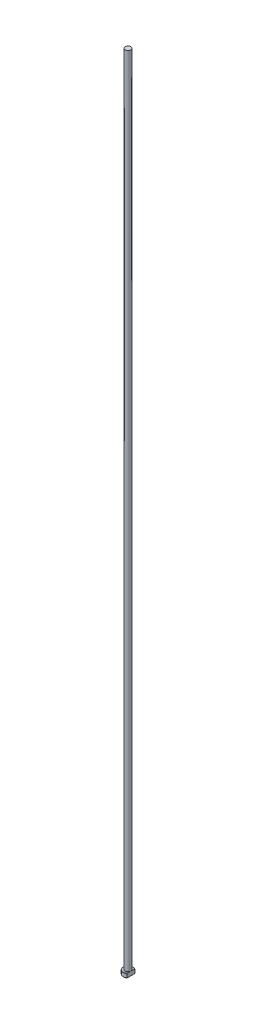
ISO-10303-21;
HEADER;
FILE_DESCRIPTION(('STEP AP214'),'2;1');
FILE_NAME('part.step','',(''),(''),'','','');
FILE_SCHEMA(('AUTOMOTIVE_DESIGN { 1 0 10303 214 1 1 1 1 }'));
ENDSEC;
DATA;
#1=APPLICATION_CONTEXT('core data for automotive mechanical design processes');
#2=APPLICATION_PROTOCOL_DEFINITION('international standard','automotive_design',2000,#1);
#3=PRODUCT_CONTEXT('',#1,'mechanical');
#4=PRODUCT('Part','Part','',(#3));
#5=PRODUCT_RELATED_PRODUCT_CATEGORY('part','',(#4));
#6=PRODUCT_DEFINITION_FORMATION('','',#4);
#7=PRODUCT_DEFINITION_CONTEXT('part definition',#1,'design');
#8=PRODUCT_DEFINITION('design','',#6,#7);
#9=PRODUCT_DEFINITION_SHAPE('','',#8);
#10=(LENGTH_UNIT() NAMED_UNIT(*) SI_UNIT(.MILLI.,.METRE.));
#11=(NAMED_UNIT(*) PLANE_ANGLE_UNIT() SI_UNIT($,.RADIAN.));
#12=(NAMED_UNIT(*) SI_UNIT($,.STERADIAN.) SOLID_ANGLE_UNIT());
#13=UNCERTAINTY_MEASURE_WITH_UNIT(LENGTH_MEASURE(1.E-05),#10,'distance_accuracy_value','');
#14=(GEOMETRIC_REPRESENTATION_CONTEXT(3) GLOBAL_UNCERTAINTY_ASSIGNED_CONTEXT((#13)) GLOBAL_UNIT_ASSIGNED_CONTEXT((#10,
#11,#12)) REPRESENTATION_CONTEXT('',''));
#15=CARTESIAN_POINT('',(0.,0.,0.));
#16=DIRECTION('',(0.,0.,1.));
#17=DIRECTION('',(1.,0.,0.));
#18=AXIS2_PLACEMENT_3D('',#15,#16,#17);
#19=CARTESIAN_POINT('',(0.,0.,0.));
#20=DIRECTION('',(0.,-1.,0.));
#21=DIRECTION('',(0.,0.,-1.));
#22=AXIS2_PLACEMENT_3D('',#19,#20,#21);
#23=PLANE('',#22);
#24=CARTESIAN_POINT('',(0.,0.,0.));
#25=DIRECTION('',(0.,-1.,0.));
#26=DIRECTION('',(0.,0.,-1.));
#27=AXIS2_PLACEMENT_3D('',#24,#25,#26);
#28=CIRCLE('',#27,5.79999999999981);
#29=CARTESIAN_POINT('',(3.49999999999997,0.,4.62493243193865));
#30=VERTEX_POINT('',#29);
#31=CARTESIAN_POINT('',(3.49999999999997,0.,-4.62493243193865));
#32=VERTEX_POINT('',#31);
#33=EDGE_CURVE('E98',#30,#32,#28,.T.);
#34=ORIENTED_EDGE('',*,*,#33,.T.);
#35=DIRECTION('',(0.,0.,1.));
#36=VECTOR('',#35,1.);
#37=CARTESIAN_POINT('',(3.49999999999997,0.,-4.87339717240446));
#38=LINE('',#37,#36);
#39=EDGE_CURVE('E83',#32,#30,#38,.T.);
#40=ORIENTED_EDGE('',*,*,#39,.T.);
#41=EDGE_LOOP('',(#34,#40));
#42=FACE_BOUND('',#41,.T.);
#43=ADVANCED_FACE('F32',(#42),#23,.T.);
#44=CARTESIAN_POINT('',(0.,259.958771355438,0.));
#45=DIRECTION('',(0.,1.,0.));
#46=DIRECTION('',(0.,0.,1.));
#47=AXIS2_PLACEMENT_3D('',#44,#45,#46);
#48=CYLINDRICAL_SURFACE('',#47,5.99999999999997);
#49=CARTESIAN_POINT('',(0.,4.80000000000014,0.));
#50=DIRECTION('',(0.,1.,0.));
#51=DIRECTION('',(0.,0.,1.));
#52=AXIS2_PLACEMENT_3D('',#49,#50,#51);
#53=CIRCLE('',#52,5.99999999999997);
#54=CARTESIAN_POINT('',(3.49999999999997,4.80000000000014,4.87339717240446));
#55=VERTEX_POINT('',#54);
#56=CARTESIAN_POINT('',(3.49999999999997,4.80000000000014,-4.87339717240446));
#57=VERTEX_POINT('',#56);
#58=EDGE_CURVE('E104',#55,#57,#53,.F.);
#59=ORIENTED_EDGE('',*,*,#58,.T.);
#60=DIRECTION('',(0.,-1.,0.));
#61=VECTOR('',#60,1.);
#62=CARTESIAN_POINT('',(3.49999999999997,1000.,-4.87339717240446));
#63=LINE('',#62,#61);
#64=CARTESIAN_POINT('',(3.49999999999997,0.200000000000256,-4.87339717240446));
#65=VERTEX_POINT('',#64);
#66=EDGE_CURVE('E183',#57,#65,#63,.T.);
#67=ORIENTED_EDGE('',*,*,#66,.T.);
#68=CARTESIAN_POINT('',(0.,0.200000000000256,0.));
#69=DIRECTION('',(0.,-1.,0.));
#70=DIRECTION('',(0.,0.,-1.));
#71=AXIS2_PLACEMENT_3D('',#68,#69,#70);
#72=CIRCLE('',#71,5.99999999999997);
#73=CARTESIAN_POINT('',(3.49999999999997,0.200000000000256,4.87339717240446));
#74=VERTEX_POINT('',#73);
#75=EDGE_CURVE('E100',#65,#74,#72,.F.);
#76=ORIENTED_EDGE('',*,*,#75,.T.);
#77=DIRECTION('',(0.,-1.,0.));
#78=VECTOR('',#77,1.);
#79=CARTESIAN_POINT('',(3.49999999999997,1000.,4.87339717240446));
#80=LINE('',#79,#78);
#81=EDGE_CURVE('E93',#55,#74,#80,.T.);
#82=ORIENTED_EDGE('',*,*,#81,.F.);
#83=EDGE_LOOP('',(#59,#67,#76,#82));
#84=FACE_BOUND('',#83,.T.);
#85=ADVANCED_FACE('F158',(#84),#48,.T.);
#86=CARTESIAN_POINT('',(-5.99999999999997,5.,0.));
#87=DIRECTION('',(0.,1.,0.));
#88=DIRECTION('',(0.,0.,1.));
#89=AXIS2_PLACEMENT_3D('',#86,#87,#88);
#90=PLANE('',#89);
#91=CARTESIAN_POINT('',(0.,5.,0.));
#92=DIRECTION('',(0.,1.,0.));
#93=DIRECTION('',(0.,0.,1.));
#94=AXIS2_PLACEMENT_3D('',#91,#92,#93);
#95=CIRCLE('',#94,5.80000000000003);
#96=CARTESIAN_POINT('',(3.49999999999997,5.,-4.62493243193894));
#97=VERTEX_POINT('',#96);
#98=CARTESIAN_POINT('',(3.49999999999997,5.,4.62493243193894));
#99=VERTEX_POINT('',#98);
#100=EDGE_CURVE('E178',#97,#99,#95,.T.);
#101=ORIENTED_EDGE('',*,*,#100,.T.);
#102=DIRECTION('',(0.,0.,-1.));
#103=VECTOR('',#102,1.);
#104=CARTESIAN_POINT('',(3.49999999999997,5.,0.));
#105=LINE('',#104,#103);
#106=CARTESIAN_POINT('',(3.49999999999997,4.99999999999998,1.19999999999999));
#107=VERTEX_POINT('',#106);
#108=EDGE_CURVE('E57',#99,#107,#105,.T.);
#109=ORIENTED_EDGE('',*,*,#108,.T.);
#110=CARTESIAN_POINT('',(0.,5.,0.));
#111=DIRECTION('',(0.,1.,0.));
#112=DIRECTION('',(0.,0.,1.));
#113=AXIS2_PLACEMENT_3D('',#110,#111,#112);
#114=CIRCLE('',#113,3.69999999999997);
#115=CARTESIAN_POINT('',(3.49999999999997,4.99999999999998,-1.19999999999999));
#116=VERTEX_POINT('',#115);
#117=EDGE_CURVE('E107',#107,#116,#114,.F.);
#118=ORIENTED_EDGE('',*,*,#117,.T.);
#119=EDGE_CURVE('E136',#116,#97,#105,.T.);
#120=ORIENTED_EDGE('',*,*,#119,.T.);
#121=EDGE_LOOP('',(#101,#109,#118,#120));
#122=FACE_BOUND('',#121,.T.);
#123=ADVANCED_FACE('F147',(#122),#90,.T.);
#124=CARTESIAN_POINT('',(0.,5.,0.));
#125=DIRECTION('',(0.,-1.,0.));
#126=DIRECTION('',(0.,0.,-1.));
#127=AXIS2_PLACEMENT_3D('',#124,#125,#126);
#128=CONICAL_SURFACE('',#127,5.80000000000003,0.785398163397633);
#129=ORIENTED_EDGE('',*,*,#58,.F.);
#130=CARTESIAN_POINT('',(3.49999999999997,-0.479658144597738,10.7229048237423));
#131=CARTESIAN_POINT('',(3.49999999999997,-0.304627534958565,10.5387821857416));
#132=CARTESIAN_POINT('',(3.49999999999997,-0.129820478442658,10.3544468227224));
#133=CARTESIAN_POINT('',(3.49999999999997,0.219261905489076,9.98527122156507));
#134=CARTESIAN_POINT('',(3.49999999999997,0.393537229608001,9.80043098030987));
#135=CARTESIAN_POINT('',(3.49999999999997,0.915594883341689,9.24486752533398));
#136=CARTESIAN_POINT('',(3.49999999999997,1.26244829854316,8.87327020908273));
#137=CARTESIAN_POINT('',(3.49999999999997,1.95718621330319,8.12195979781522));
#138=CARTESIAN_POINT('',(3.49999999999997,2.30502483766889,7.74220412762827));
#139=CARTESIAN_POINT('',(3.49999999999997,2.8226786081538,7.16898192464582));
#140=CARTESIAN_POINT('',(3.49999999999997,2.99451670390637,6.97734293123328));
#141=CARTESIAN_POINT('',(3.49999999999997,3.33649221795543,6.59255347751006));
#142=CARTESIAN_POINT('',(3.49999999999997,3.5066296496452,6.39940302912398));
#143=CARTESIAN_POINT('',(3.49999999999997,3.80984794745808,6.05127590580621));
#144=CARTESIAN_POINT('',(3.49999999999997,3.94332939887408,5.89664839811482));
#145=CARTESIAN_POINT('',(3.49999999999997,4.20861192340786,5.58595941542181));
#146=CARTESIAN_POINT('',(3.49999999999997,4.3404130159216,5.42989795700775));
#147=CARTESIAN_POINT('',(3.49999999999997,4.60204886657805,5.11587234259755));
#148=CARTESIAN_POINT('',(3.49999999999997,4.73188156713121,4.95790646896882));
#149=CARTESIAN_POINT('',(3.49999999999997,4.98887681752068,4.63982145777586));
#150=CARTESIAN_POINT('',(3.49999999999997,5.11603946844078,4.47970240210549));
#151=CARTESIAN_POINT('',(3.49999999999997,5.36664013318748,4.15712646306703));
#152=CARTESIAN_POINT('',(3.49999999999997,5.49008567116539,3.99467544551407));
#153=CARTESIAN_POINT('',(3.49999999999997,5.73245687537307,3.66637038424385));
#154=CARTESIAN_POINT('',(3.49999999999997,5.8513816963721,3.50051571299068));
#155=CARTESIAN_POINT('',(3.49999999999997,6.08288587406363,3.16479623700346));
#156=CARTESIAN_POINT('',(3.49999999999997,6.19547497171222,2.99493819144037));
#157=CARTESIAN_POINT('',(3.49999999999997,6.41208556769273,2.64987956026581));
#158=CARTESIAN_POINT('',(3.49999999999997,6.51611116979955,2.47468158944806));
#159=CARTESIAN_POINT('',(3.49999999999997,6.68667355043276,2.16371702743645));
#160=CARTESIAN_POINT('',(3.49999999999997,6.75595020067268,2.02946380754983));
#161=CARTESIAN_POINT('',(3.49999999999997,6.88572771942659,1.75668071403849));
#162=CARTESIAN_POINT('',(3.49999999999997,6.94622644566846,1.61814980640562));
#163=CARTESIAN_POINT('',(3.49999999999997,7.05535730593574,1.33751093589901));
#164=CARTESIAN_POINT('',(3.49999999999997,7.104067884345,1.19543397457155));
#165=CARTESIAN_POINT('',(3.49999999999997,7.18698872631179,0.907101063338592));
#166=CARTESIAN_POINT('',(3.49999999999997,7.22121012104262,0.76084841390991));
#167=CARTESIAN_POINT('',(3.49999999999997,7.26487302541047,0.507831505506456));
#168=CARTESIAN_POINT('',(3.49999999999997,7.2786104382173,0.401805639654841));
#169=CARTESIAN_POINT('',(3.49999999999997,7.29650595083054,0.188947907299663));
#170=CARTESIAN_POINT('',(3.49999999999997,7.30066582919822,0.0821161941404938));
#171=CARTESIAN_POINT('',(3.49999999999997,7.29916002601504,-0.131492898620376));
#172=CARTESIAN_POINT('',(3.49999999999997,7.29349282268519,-0.238270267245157));
#173=CARTESIAN_POINT('',(3.49999999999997,7.27266406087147,-0.45089516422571));
#174=CARTESIAN_POINT('',(3.49999999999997,7.25750065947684,-0.556742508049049));
#175=CARTESIAN_POINT('',(3.49999999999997,7.21256554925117,-0.798589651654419));
#176=CARTESIAN_POINT('',(3.49999999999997,7.1797624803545,-0.934025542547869));
#177=CARTESIAN_POINT('',(3.49999999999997,7.10180151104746,-1.20127435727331));
#178=CARTESIAN_POINT('',(3.49999999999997,7.05663717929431,-1.33308535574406));
#179=CARTESIAN_POINT('',(3.49999999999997,6.95617548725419,-1.59358719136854));
#180=CARTESIAN_POINT('',(3.49999999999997,6.90082290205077,-1.72225647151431));
#181=CARTESIAN_POINT('',(3.49999999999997,6.81196782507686,-1.91246868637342));
#182=CARTESIAN_POINT('',(3.49999999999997,6.78138093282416,-1.97540288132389));
#183=CARTESIAN_POINT('',(3.49999999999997,6.71848328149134,-2.10040375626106));
#184=CARTESIAN_POINT('',(3.49999999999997,6.68617255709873,-2.16247045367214));
#185=CARTESIAN_POINT('',(3.49999999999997,6.59348343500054,-2.33529342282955));
#186=CARTESIAN_POINT('',(3.49999999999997,6.53139715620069,-2.44513435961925));
#187=CARTESIAN_POINT('',(3.49999999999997,6.40327495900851,-2.662497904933));
#188=CARTESIAN_POINT('',(3.49999999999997,6.33723828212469,-2.77002006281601));
#189=CARTESIAN_POINT('',(3.49999999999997,6.20193961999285,-2.98310926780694));
#190=CARTESIAN_POINT('',(3.49999999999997,6.13267551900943,-3.08867496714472));
#191=CARTESIAN_POINT('',(3.49999999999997,5.99154722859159,-3.29805772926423));
#192=CARTESIAN_POINT('',(3.49999999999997,5.91968285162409,-3.40187466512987));
#193=CARTESIAN_POINT('',(3.49999999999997,5.70053198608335,-3.71160333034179));
#194=CARTESIAN_POINT('',(3.49999999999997,5.55004115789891,-3.91524708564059));
#195=CARTESIAN_POINT('',(3.49999999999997,5.24323373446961,-4.31793623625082));
#196=CARTESIAN_POINT('',(3.49999999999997,5.08691924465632,-4.51698325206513));
#197=CARTESIAN_POINT('',(3.49999999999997,4.76917008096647,-4.91272714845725));
#198=CARTESIAN_POINT('',(3.49999999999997,4.60771212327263,-5.10940527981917));
#199=CARTESIAN_POINT('',(3.49999999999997,4.28159454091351,-5.50010578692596));
#200=CARTESIAN_POINT('',(3.49999999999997,4.11693466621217,-5.69412795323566));
#201=CARTESIAN_POINT('',(3.49999999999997,3.78544370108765,-6.07977702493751));
#202=CARTESIAN_POINT('',(3.49999999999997,3.61861641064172,-6.27140720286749));
#203=CARTESIAN_POINT('',(3.49999999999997,3.28306967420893,-6.65300504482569));
#204=CARTESIAN_POINT('',(3.49999999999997,3.11435020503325,-6.84297268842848));
#205=CARTESIAN_POINT('',(3.49999999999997,2.66324311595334,-7.3468737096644));
#206=CARTESIAN_POINT('',(3.49999999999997,2.37954008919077,-7.65962881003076));
#207=CARTESIAN_POINT('',(3.49999999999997,1.80910784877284,-8.2826163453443));
#208=CARTESIAN_POINT('',(3.49999999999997,1.52237733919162,-8.59284759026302));
#209=CARTESIAN_POINT('',(3.49999999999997,0.950562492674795,-9.207276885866));
#210=CARTESIAN_POINT('',(3.49999999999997,0.665505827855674,-9.51150072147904));
#211=CARTESIAN_POINT('',(3.49999999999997,0.0939335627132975,-10.1182972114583));
#212=CARTESIAN_POINT('',(3.49999999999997,-0.192581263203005,-10.4208705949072));
#213=CARTESIAN_POINT('',(3.49999999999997,-0.47965814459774,-10.7229048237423));
#214=B_SPLINE_CURVE_WITH_KNOTS('',3,(#130,#131,#132,#133,#134,#135,#136,#137,#138,#139,#140,
#141,#142,#143,#144,#145,#146,#147,#148,#149,#150,#151,#152,#153,#154,#155,#156,#157,#158,#159,
#160,#161,#162,#163,#164,#165,#166,#167,#168,#169,#170,#171,#172,#173,#174,#175,#176,#177,#178,
#179,#180,#181,#182,#183,#184,#185,#186,#187,#188,#189,#190,#191,#192,#193,#194,#195,#196,#197,
#198,#199,#200,#201,#202,#203,#204,#205,#206,#207,#208,#209,#210,#211,#212,#213),.UNSPECIFIED.,
.F.,.F.,(4,2,2,2,2,2,2,2,2,2,2,2,2,2,2,2,2,2,2,2,2,2,2,2,2,2,2,2,2,2,2,2,2,2,2,2,2,2,2,2,2,4),
(0.,0.762123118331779,1.524250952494,3.04920520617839,4.59410962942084,5.36629689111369,
6.13847806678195,6.75128402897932,7.36408291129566,7.97748343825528,8.59086070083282,
9.20289910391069,9.81505138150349,10.4262352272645,11.0371244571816,11.4901076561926,
11.9432012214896,12.3931912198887,12.8428348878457,13.1631796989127,13.4834650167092,
13.8037999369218,14.1241970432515,14.5415079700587,14.9590364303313,15.378898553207,
15.5887982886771,15.7986938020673,16.1771020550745,16.5555831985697,16.9343160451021,
17.313076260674,18.0725457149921,18.8317432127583,19.5950831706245,20.3584829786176,
21.1206884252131,21.8829032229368,23.1496528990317,24.4169687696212,25.6676760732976,
26.9177769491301),.UNSPECIFIED.);
#215=EDGE_CURVE('E135',#55,#99,#214,.T.);
#216=ORIENTED_EDGE('',*,*,#215,.T.);
#217=ORIENTED_EDGE('',*,*,#100,.F.);
#218=EDGE_CURVE('E127',#97,#57,#214,.T.);
#219=ORIENTED_EDGE('',*,*,#218,.T.);
#220=EDGE_LOOP('',(#129,#216,#217,#219));
#221=FACE_BOUND('',#220,.T.);
#222=ADVANCED_FACE('F143',(#221),#128,.T.);
#223=CARTESIAN_POINT('',(0.,0.200000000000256,0.));
#224=DIRECTION('',(0.,1.,0.));
#225=DIRECTION('',(0.,0.,1.));
#226=AXIS2_PLACEMENT_3D('',#223,#224,#225);
#227=CONICAL_SURFACE('',#226,5.99999999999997,0.785398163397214);
#228=ORIENTED_EDGE('',*,*,#75,.F.);
#229=CARTESIAN_POINT('',(3.49999999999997,5.47965814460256,-10.7229048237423));
#230=CARTESIAN_POINT('',(3.49999999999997,5.30462753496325,-10.5387821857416));
#231=CARTESIAN_POINT('',(3.49999999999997,5.12982047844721,-10.3544468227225));
#232=CARTESIAN_POINT('',(3.49999999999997,4.78073809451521,-9.98527122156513));
#233=CARTESIAN_POINT('',(3.49999999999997,4.60646277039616,-9.80043098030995));
#234=CARTESIAN_POINT('',(3.49999999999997,4.08440511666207,-9.2448675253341));
#235=CARTESIAN_POINT('',(3.49999999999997,3.73755170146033,-8.87327020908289));
#236=CARTESIAN_POINT('',(3.49999999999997,3.04281378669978,-8.12195979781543));
#237=CARTESIAN_POINT('',(3.49999999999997,2.69497516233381,-7.74220412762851));
#238=CARTESIAN_POINT('',(3.49999999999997,2.17732139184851,-7.16898192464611));
#239=CARTESIAN_POINT('',(3.49999999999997,2.00548329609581,-6.97734293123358));
#240=CARTESIAN_POINT('',(3.49999999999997,1.66350778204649,-6.5925534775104));
#241=CARTESIAN_POINT('',(3.49999999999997,1.49337035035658,-6.39940302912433));
#242=CARTESIAN_POINT('',(3.49999999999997,1.19015205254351,-6.05127590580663));
#243=CARTESIAN_POINT('',(3.49999999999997,1.05667060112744,-5.89664839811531));
#244=CARTESIAN_POINT('',(3.49999999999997,0.791388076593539,-5.58595941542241));
#245=CARTESIAN_POINT('',(3.49999999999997,0.659586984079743,-5.42989795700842));
#246=CARTESIAN_POINT('',(3.49999999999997,0.397951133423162,-5.11587234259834));
#247=CARTESIAN_POINT('',(3.49999999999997,0.268118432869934,-4.95790646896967));
#248=CARTESIAN_POINT('',(3.49999999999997,0.0111231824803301,-4.63982145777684));
#249=CARTESIAN_POINT('',(3.49999999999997,-0.116039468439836,-4.47970240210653));
#250=CARTESIAN_POINT('',(3.49999999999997,-0.366640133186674,-4.15712646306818));
#251=CARTESIAN_POINT('',(3.49999999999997,-0.490085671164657,-3.99467544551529));
#252=CARTESIAN_POINT('',(3.49999999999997,-0.732456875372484,-3.66637038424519));
#253=CARTESIAN_POINT('',(3.49999999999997,-0.851381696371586,-3.50051571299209));
#254=CARTESIAN_POINT('',(3.49999999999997,-1.08288587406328,-3.16479623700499));
#255=CARTESIAN_POINT('',(3.49999999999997,-1.19547497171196,-2.99493819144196));
#256=CARTESIAN_POINT('',(3.49999999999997,-1.41208556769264,-2.64987956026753));
#257=CARTESIAN_POINT('',(3.49999999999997,-1.51611116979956,-2.47468158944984));
#258=CARTESIAN_POINT('',(3.49999999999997,-1.68667355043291,-2.16371702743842));
#259=CARTESIAN_POINT('',(3.49999999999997,-1.75595020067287,-2.02946380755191));
#260=CARTESIAN_POINT('',(3.49999999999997,-1.8857277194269,-1.75668071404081));
#261=CARTESIAN_POINT('',(3.49999999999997,-1.94622644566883,-1.61814980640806));
#262=CARTESIAN_POINT('',(3.49999999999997,-2.05535730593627,-1.33751093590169));
#263=CARTESIAN_POINT('',(3.49999999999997,-2.10406788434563,-1.19543397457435));
#264=CARTESIAN_POINT('',(3.49999999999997,-2.18698872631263,-0.907101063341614));
#265=CARTESIAN_POINT('',(3.49999999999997,-2.22121012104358,-0.760848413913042));
#266=CARTESIAN_POINT('',(3.49999999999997,-2.26487302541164,-0.507831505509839));
#267=CARTESIAN_POINT('',(3.49999999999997,-2.27861043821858,-0.40180563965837));
#268=CARTESIAN_POINT('',(3.49999999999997,-2.29650595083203,-0.188947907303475));
#269=CARTESIAN_POINT('',(3.49999999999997,-2.30066582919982,-0.0821161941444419));
#270=CARTESIAN_POINT('',(3.49999999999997,-2.29916002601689,0.131492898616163));
#271=CARTESIAN_POINT('',(3.49999999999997,-2.29349282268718,0.238270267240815));
#272=CARTESIAN_POINT('',(3.49999999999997,-2.27266406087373,0.450895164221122));
#273=CARTESIAN_POINT('',(3.49999999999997,-2.25750065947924,0.556742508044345));
#274=CARTESIAN_POINT('',(3.49999999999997,-2.21256554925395,0.798589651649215));
#275=CARTESIAN_POINT('',(3.49999999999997,-2.17976248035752,0.934025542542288));
#276=CARTESIAN_POINT('',(3.49999999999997,-2.10180151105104,1.201274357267));
#277=CARTESIAN_POINT('',(3.49999999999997,-2.05663717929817,1.3330853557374));
#278=CARTESIAN_POINT('',(3.49999999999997,-1.95617548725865,1.59358719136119));
#279=CARTESIAN_POINT('',(3.49999999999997,-1.90082290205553,1.72225647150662));
#280=CARTESIAN_POINT('',(3.49999999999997,-1.81196782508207,1.91246868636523));
#281=CARTESIAN_POINT('',(3.49999999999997,-1.78138093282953,1.97540288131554));
#282=CARTESIAN_POINT('',(3.49999999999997,-1.71848328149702,2.10040375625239));
#283=CARTESIAN_POINT('',(3.49999999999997,-1.68617255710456,2.16247045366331));
#284=CARTESIAN_POINT('',(3.49999999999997,-1.59348343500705,2.33529342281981));
#285=CARTESIAN_POINT('',(3.49999999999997,-1.53139715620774,2.44513435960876));
#286=CARTESIAN_POINT('',(3.49999999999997,-1.40327495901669,2.66249790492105));
#287=CARTESIAN_POINT('',(3.49999999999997,-1.33723828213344,2.77002006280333));
#288=CARTESIAN_POINT('',(3.49999999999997,-1.20193962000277,2.98310926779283));
#289=CARTESIAN_POINT('',(3.49999999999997,-1.13267551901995,3.0886749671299));
#290=CARTESIAN_POINT('',(3.49999999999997,-0.991547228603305,3.29805772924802));
#291=CARTESIAN_POINT('',(3.49999999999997,-0.919682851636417,3.40187466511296));
#292=CARTESIAN_POINT('',(3.49999999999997,-0.700531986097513,3.71160333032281));
#293=CARTESIAN_POINT('',(3.49999999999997,-0.550041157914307,3.91524708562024));
#294=CARTESIAN_POINT('',(3.49999999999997,-0.243233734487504,4.31793623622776));
#295=CARTESIAN_POINT('',(3.49999999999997,-0.0869192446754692,4.51698325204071));
#296=CARTESIAN_POINT('',(3.49999999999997,0.230829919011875,4.91272714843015));
#297=CARTESIAN_POINT('',(3.49999999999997,0.392287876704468,5.10940527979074));
#298=CARTESIAN_POINT('',(3.49999999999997,0.718405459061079,5.50010578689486));
#299=CARTESIAN_POINT('',(3.49999999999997,0.883065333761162,5.69412795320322));
#300=CARTESIAN_POINT('',(3.49999999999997,1.21455629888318,6.07977702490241));
#301=CARTESIAN_POINT('',(3.49999999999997,1.38138358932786,6.27140720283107));
#302=CARTESIAN_POINT('',(3.49999999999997,1.71693032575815,6.65300504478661));
#303=CARTESIAN_POINT('',(3.49999999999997,1.88564979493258,6.84297268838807));
#304=CARTESIAN_POINT('',(3.49999999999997,2.33675688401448,7.34687370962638));
#305=CARTESIAN_POINT('',(3.49999999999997,2.62045991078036,7.65962880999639));
#306=CARTESIAN_POINT('',(3.49999999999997,3.19089215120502,8.28261634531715));
#307=CARTESIAN_POINT('',(3.49999999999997,3.47762266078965,8.59284759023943));
#308=CARTESIAN_POINT('',(3.49999999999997,4.04943750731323,9.20727688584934));
#309=CARTESIAN_POINT('',(3.49999999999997,4.33449417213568,9.51150072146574));
#310=CARTESIAN_POINT('',(3.49999999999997,4.90606643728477,10.1182972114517));
#311=CARTESIAN_POINT('',(3.49999999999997,5.19258126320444,10.4208705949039));
#312=CARTESIAN_POINT('',(3.49999999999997,5.47965814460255,10.7229048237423));
#313=B_SPLINE_CURVE_WITH_KNOTS('',3,(#229,#230,#231,#232,#233,#234,#235,#236,#237,#238,#239,
#240,#241,#242,#243,#244,#245,#246,#247,#248,#249,#250,#251,#252,#253,#254,#255,#256,#257,#258,
#259,#260,#261,#262,#263,#264,#265,#266,#267,#268,#269,#270,#271,#272,#273,#274,#275,#276,#277,
#278,#279,#280,#281,#282,#283,#284,#285,#286,#287,#288,#289,#290,#291,#292,#293,#294,#295,#296,
#297,#298,#299,#300,#301,#302,#303,#304,#305,#306,#307,#308,#309,#310,#311,#312),.UNSPECIFIED.,
.F.,.F.,(4,2,2,2,2,2,2,2,2,2,2,2,2,2,2,2,2,2,2,2,2,2,2,2,2,2,2,2,2,2,2,2,2,2,2,2,2,2,2,2,2,4),
(0.,0.762123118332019,1.52425095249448,3.04920520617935,4.59410962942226,5.36629689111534,
6.13847806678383,6.75128402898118,7.36408291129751,7.97748343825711,8.59086070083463,
9.20289910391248,9.81505138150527,10.4262352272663,11.0371244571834,11.4901076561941,
11.9432012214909,12.3931912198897,12.8428348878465,13.163179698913,13.4834650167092,
13.8037999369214,14.1241970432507,14.5415079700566,14.9590364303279,15.3788985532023,
15.5887982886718,15.7986938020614,16.1771020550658,16.5555831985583,16.9343160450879,
17.3130762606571,18.0725457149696,18.8317432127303,19.595083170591,20.3584829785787,
21.1206884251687,21.8829032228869,23.1496528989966,24.4169687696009,25.6676760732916,
26.9177769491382),.UNSPECIFIED.);
#314=EDGE_CURVE('E86',#65,#32,#313,.T.);
#315=ORIENTED_EDGE('',*,*,#314,.T.);
#316=ORIENTED_EDGE('',*,*,#33,.F.);
#317=EDGE_CURVE('E89',#30,#74,#313,.T.);
#318=ORIENTED_EDGE('',*,*,#317,.T.);
#319=EDGE_LOOP('',(#228,#315,#316,#318));
#320=FACE_BOUND('',#319,.T.);
#321=ADVANCED_FACE('F97',(#320),#227,.T.);
#322=CARTESIAN_POINT('',(0.,5.19999999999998,0.));
#323=DIRECTION('',(0.,1.,0.));
#324=DIRECTION('',(0.,0.,1.));
#325=AXIS2_PLACEMENT_3D('',#322,#323,#324);
#326=TOROIDAL_SURFACE('',#325,3.69999999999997,0.2);
#327=CARTESIAN_POINT('',(3.49999999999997,5.19999999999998,0.));
#328=CARTESIAN_POINT('',(3.49999999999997,5.20000050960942,9.98094828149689E-11));
#329=CARTESIAN_POINT('',(3.49999999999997,5.20000101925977,-2.13486746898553E-07));
#330=CARTESIAN_POINT('',(3.49999999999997,5.20000196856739,-7.957591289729E-07));
#331=CARTESIAN_POINT('',(3.49999999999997,5.20000239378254,-1.17925839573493E-06));
#332=CARTESIAN_POINT('',(3.49999999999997,5.20000328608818,-2.10014972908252E-06));
#333=CARTESIAN_POINT('',(3.49999999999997,5.20000373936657,-2.65249908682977E-06));
#334=CARTESIAN_POINT('',(3.49999999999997,5.20000454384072,-3.79112889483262E-06));
#335=CARTESIAN_POINT('',(3.49999999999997,5.20000489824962,-4.37533521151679E-06));
#336=CARTESIAN_POINT('',(3.49999999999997,5.20000623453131,-6.66270059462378E-06));
#337=CARTESIAN_POINT('',(3.49999999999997,5.20000714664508,-8.40961025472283E-06));
#338=CARTESIAN_POINT('',(3.49999999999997,5.20000862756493,-1.18496824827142E-05));
#339=CARTESIAN_POINT('',(3.49999999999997,5.20000922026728,-1.35329548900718E-05));
#340=CARTESIAN_POINT('',(3.49999999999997,5.20001174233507,-2.07268950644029E-05));
#341=CARTESIAN_POINT('',(3.49999999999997,5.20001365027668,-2.62477536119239E-05));
#342=CARTESIAN_POINT('',(3.49999999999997,5.20001642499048,-3.66274572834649E-05));
#343=CARTESIAN_POINT('',(3.49999999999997,5.20001740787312,-4.14549355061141E-05));
#344=CARTESIAN_POINT('',(3.49999999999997,5.20002462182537,-7.75352102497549E-05));
#345=CARTESIAN_POINT('',(3.49999999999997,5.20003014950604,-0.000108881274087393));
#346=CARTESIAN_POINT('',(3.49999999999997,5.20005434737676,-0.000233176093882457));
#347=CARTESIAN_POINT('',(3.49999999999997,5.20007737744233,-0.000325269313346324));
#348=CARTESIAN_POINT('',(3.49999999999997,5.20016742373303,-0.000691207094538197));
#349=CARTESIAN_POINT('',(3.49999999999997,5.20023166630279,-0.000965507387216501));
#350=CARTESIAN_POINT('',(3.49999999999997,5.20048971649,-0.0020594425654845));
#351=CARTESIAN_POINT('',(3.49999999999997,5.20068705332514,-0.00287847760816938));
#352=CARTESIAN_POINT('',(3.49999999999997,5.20150941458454,-0.00630050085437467));
#353=CARTESIAN_POINT('',(3.49999999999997,5.20212997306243,-0.00890424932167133));
#354=CARTESIAN_POINT('',(3.49999999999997,5.20703918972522,-0.0294912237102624));
#355=CARTESIAN_POINT('',(3.49999999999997,5.21134300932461,-0.0474719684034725));
#356=CARTESIAN_POINT('',(3.49999999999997,5.21975360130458,-0.0827191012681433));
#357=CARTESIAN_POINT('',(3.49999999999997,5.22386136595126,-0.0999852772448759));
#358=CARTESIAN_POINT('',(3.49999999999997,5.2372401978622,-0.156405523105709));
#359=CARTESIAN_POINT('',(3.49999999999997,5.24645854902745,-0.195572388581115));
#360=CARTESIAN_POINT('',(3.49999999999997,5.26203234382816,-0.262828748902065));
#361=CARTESIAN_POINT('',(3.49999999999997,5.26845671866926,-0.290902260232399));
#362=CARTESIAN_POINT('',(3.49999999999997,5.28094671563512,-0.346379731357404));
#363=CARTESIAN_POINT('',(3.49999999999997,5.28701730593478,-0.373782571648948));
#364=CARTESIAN_POINT('',(3.49999999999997,5.30077691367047,-0.437211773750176));
#365=CARTESIAN_POINT('',(3.49999999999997,5.3083789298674,-0.473257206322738));
#366=CARTESIAN_POINT('',(3.49999999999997,5.32309409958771,-0.545736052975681));
#367=CARTESIAN_POINT('',(3.49999999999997,5.33020304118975,-0.582170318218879));
#368=CARTESIAN_POINT('',(3.49999999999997,5.35161649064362,-0.697757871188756));
#369=CARTESIAN_POINT('',(3.49999999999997,5.36463967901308,-0.777158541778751));
#370=CARTESIAN_POINT('',(3.49999999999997,5.3843837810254,-0.92756184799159));
#371=CARTESIAN_POINT('',(3.49999999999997,5.39165512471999,-0.998486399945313));
#372=CARTESIAN_POINT('',(3.49999999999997,5.3979989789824,-1.10437287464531));
#373=CARTESIAN_POINT('',(3.49999999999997,5.39936233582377,-1.13919451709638));
#374=CARTESIAN_POINT('',(3.49999999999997,5.40028946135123,-1.20885098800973));
#375=CARTESIAN_POINT('',(3.49999999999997,5.39985418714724,-1.24368579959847));
#376=CARTESIAN_POINT('',(3.49999999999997,5.39686573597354,-1.30963279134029));
#377=CARTESIAN_POINT('',(3.49999999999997,5.39453835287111,-1.34075403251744));
#378=CARTESIAN_POINT('',(3.49999999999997,5.38750048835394,-1.40298456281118));
#379=CARTESIAN_POINT('',(3.49999999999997,5.38277118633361,-1.43409178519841));
#380=CARTESIAN_POINT('',(3.49999999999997,5.37000596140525,-1.49609278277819));
#381=CARTESIAN_POINT('',(3.49999999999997,5.36193044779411,-1.52697933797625));
#382=CARTESIAN_POINT('',(3.49999999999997,5.34614337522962,-1.57192957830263));
#383=CARTESIAN_POINT('',(3.49999999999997,5.3402919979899,-1.5866404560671));
#384=CARTESIAN_POINT('',(3.49999999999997,5.32701491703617,-1.6153215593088));
#385=CARTESIAN_POINT('',(3.49999999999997,5.31959341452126,-1.6292936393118));
#386=CARTESIAN_POINT('',(3.49999999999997,5.30547056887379,-1.65150372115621));
#387=CARTESIAN_POINT('',(3.49999999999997,5.29934759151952,-1.6601058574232));
#388=CARTESIAN_POINT('',(3.49999999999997,5.28595656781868,-1.67637400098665));
#389=CARTESIAN_POINT('',(3.49999999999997,5.27869146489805,-1.68404232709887));
#390=CARTESIAN_POINT('',(3.49999999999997,5.26587375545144,-1.69518467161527));
#391=CARTESIAN_POINT('',(3.49999999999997,5.26073958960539,-1.69913647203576));
#392=CARTESIAN_POINT('',(3.49999999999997,5.24994100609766,-1.70624293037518));
#393=CARTESIAN_POINT('',(3.49999999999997,5.24427723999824,-1.70939855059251));
#394=CARTESIAN_POINT('',(3.49999999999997,5.23351378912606,-1.71418736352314));
#395=CARTESIAN_POINT('',(3.49999999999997,5.22849079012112,-1.71599090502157));
#396=CARTESIAN_POINT('',(3.49999999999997,5.21821361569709,-1.71873268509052));
#397=CARTESIAN_POINT('',(3.49999999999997,5.21295968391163,-1.71967181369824));
#398=CARTESIAN_POINT('',(3.49999999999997,5.20234462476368,-1.72059432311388));
#399=CARTESIAN_POINT('',(3.49999999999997,5.19698314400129,-1.72057373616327));
#400=CARTESIAN_POINT('',(3.49999999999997,5.18635093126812,-1.71956893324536));
#401=CARTESIAN_POINT('',(3.49999999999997,5.18108024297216,-1.71858426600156));
#402=CARTESIAN_POINT('',(3.49999999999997,5.17106869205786,-1.71582968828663));
#403=CARTESIAN_POINT('',(3.49999999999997,5.16631466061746,-1.71410641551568));
#404=CARTESIAN_POINT('',(3.49999999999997,5.15709718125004,-1.71001459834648));
#405=CARTESIAN_POINT('',(3.49999999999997,5.15263381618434,-1.70764587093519));
#406=CARTESIAN_POINT('',(3.49999999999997,5.14110717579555,-1.70060771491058));
#407=CARTESIAN_POINT('',(3.49999999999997,5.13433222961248,-1.69546710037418));
#408=CARTESIAN_POINT('',(3.49999999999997,5.12164557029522,-1.68420869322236));
#409=CARTESIAN_POINT('',(3.49999999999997,5.11573697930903,-1.67808752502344));
#410=CARTESIAN_POINT('',(3.49999999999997,5.10028952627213,-1.66008531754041));
#411=CARTESIAN_POINT('',(3.49999999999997,5.09159238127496,-1.64748936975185));
#412=CARTESIAN_POINT('',(3.49999999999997,5.07604019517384,-1.62125022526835));
#413=CARTESIAN_POINT('',(3.49999999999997,5.06918749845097,-1.60760572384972));
#414=CARTESIAN_POINT('',(3.49999999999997,5.05635908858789,-1.57851190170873));
#415=CARTESIAN_POINT('',(3.49999999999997,5.05050870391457,-1.56300807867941));
#416=CARTESIAN_POINT('',(3.49999999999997,5.04009412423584,-1.53156759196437));
#417=CARTESIAN_POINT('',(3.49999999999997,5.03553147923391,-1.51563043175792));
#418=CARTESIAN_POINT('',(3.49999999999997,5.02331191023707,-1.46712048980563));
#419=CARTESIAN_POINT('',(3.49999999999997,5.01724153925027,-1.4341495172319));
#420=CARTESIAN_POINT('',(3.49999999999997,5.00883071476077,-1.37348993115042));
#421=CARTESIAN_POINT('',(3.49999999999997,5.00603148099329,-1.34585663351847));
#422=CARTESIAN_POINT('',(3.49999999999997,5.00204762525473,-1.29046925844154));
#423=CARTESIAN_POINT('',(3.49999999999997,5.00086336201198,-1.26271515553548));
#424=CARTESIAN_POINT('',(3.49999999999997,4.99925913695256,-1.17922229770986));
#425=CARTESIAN_POINT('',(3.49999999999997,5.00080993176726,-1.1234488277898));
#426=CARTESIAN_POINT('',(3.49999999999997,5.00738569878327,-1.01528124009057));
#427=CARTESIAN_POINT('',(3.49999999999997,5.01221131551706,-0.962872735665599));
#428=CARTESIAN_POINT('',(3.49999999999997,5.02425367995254,-0.858750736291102));
#429=CARTESIAN_POINT('',(3.49999999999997,5.03145152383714,-0.807035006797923));
#430=CARTESIAN_POINT('',(3.49999999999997,5.04786442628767,-0.702500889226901));
#431=CARTESIAN_POINT('',(3.49999999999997,5.05712869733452,-0.649690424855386));
#432=CARTESIAN_POINT('',(3.49999999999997,5.07730630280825,-0.542969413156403));
#433=CARTESIAN_POINT('',(3.49999999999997,5.08825618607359,-0.489065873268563));
#434=CARTESIAN_POINT('',(3.49999999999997,5.10770336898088,-0.397738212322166));
#435=CARTESIAN_POINT('',(3.49999999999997,5.11594150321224,-0.360258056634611));
#436=CARTESIAN_POINT('',(3.49999999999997,5.1326812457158,-0.285797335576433));
#437=CARTESIAN_POINT('',(3.49999999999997,5.14117887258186,-0.248815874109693));
#438=CARTESIAN_POINT('',(3.49999999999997,5.15740628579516,-0.179140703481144));
#439=CARTESIAN_POINT('',(3.49999999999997,5.16511243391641,-0.146441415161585));
#440=CARTESIAN_POINT('',(3.49999999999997,5.18096853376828,-0.0796648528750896));
#441=CARTESIAN_POINT('',(3.49999999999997,5.18912333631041,-0.045588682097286));
#442=CARTESIAN_POINT('',(3.49999999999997,5.19787118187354,-0.00889903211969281));
#443=CARTESIAN_POINT('',(3.49999999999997,5.19849305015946,-0.00629009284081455));
#444=CARTESIAN_POINT('',(3.49999999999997,5.19931571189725,-0.00286690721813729));
#445=CARTESIAN_POINT('',(3.49999999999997,5.19951207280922,-0.0020519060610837));
#446=CARTESIAN_POINT('',(3.49999999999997,5.19976893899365,-0.0009629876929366));
#447=CARTESIAN_POINT('',(3.49999999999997,5.19983295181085,-0.00068966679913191));
#448=CARTESIAN_POINT('',(3.49999999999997,5.19992272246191,-0.000324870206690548));
#449=CARTESIAN_POINT('',(3.49999999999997,5.19994571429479,-0.000232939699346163));
#450=CARTESIAN_POINT('',(3.49999999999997,5.19996987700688,-0.000108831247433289));
#451=CARTESIAN_POINT('',(3.49999999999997,5.19997540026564,-7.75074375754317E-05));
#452=CARTESIAN_POINT('',(3.49999999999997,5.19998260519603,-4.1449950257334E-05));
#453=CARTESIAN_POINT('',(3.49999999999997,5.19998358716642,-3.66236562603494E-05));
#454=CARTESIAN_POINT('',(3.49999999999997,5.19998635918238,-2.62464271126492E-05));
#455=CARTESIAN_POINT('',(3.49999999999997,5.19998826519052,-2.07267962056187E-05));
#456=CARTESIAN_POINT('',(3.49999999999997,5.19999078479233,-1.353414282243E-05));
#457=CARTESIAN_POINT('',(3.49999999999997,5.19999137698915,-1.18509583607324E-05));
#458=CARTESIAN_POINT('',(3.49999999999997,5.19999285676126,-8.4109834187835E-06));
#459=CARTESIAN_POINT('',(3.49999999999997,5.19999376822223,-6.66407126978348E-06));
#460=CARTESIAN_POINT('',(3.49999999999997,5.19999510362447,-4.37661194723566E-06));
#461=CARTESIAN_POINT('',(3.49999999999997,5.19999545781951,-3.79235333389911E-06));
#462=CARTESIAN_POINT('',(3.49999999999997,5.19999626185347,-2.65358032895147E-06));
#463=CARTESIAN_POINT('',(3.49999999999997,5.19999671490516,-2.10113839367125E-06));
#464=CARTESIAN_POINT('',(3.49999999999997,5.1999976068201,-1.18003190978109E-06));
#465=CARTESIAN_POINT('',(3.49999999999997,5.19999803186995,-7.96418762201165E-07));
#466=CARTESIAN_POINT('',(3.49999999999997,5.19999898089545,-2.13855187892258E-07));
#467=CARTESIAN_POINT('',(3.49999999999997,5.19999949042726,-9.98022935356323E-11));
#468=CARTESIAN_POINT('',(3.49999999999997,5.19999999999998,0.));
#469=B_SPLINE_CURVE_WITH_KNOTS('',3,(#327,#328,#329,#330,#331,#332,#333,#334,#335,#336,#337,
#338,#339,#340,#341,#342,#343,#344,#345,#346,#347,#348,#349,#350,#351,#352,#353,#354,#355,#356,
#357,#358,#359,#360,#361,#362,#363,#364,#365,#366,#367,#368,#369,#370,#371,#372,#373,#374,#375,
#376,#377,#378,#379,#380,#381,#382,#383,#384,#385,#386,#387,#388,#389,#390,#391,#392,#393,#394,
#395,#396,#397,#398,#399,#400,#401,#402,#403,#404,#405,#406,#407,#408,#409,#410,#411,#412,#413,
#414,#415,#416,#417,#418,#419,#420,#421,#422,#423,#424,#425,#426,#427,#428,#429,#430,#431,#432,
#433,#434,#435,#436,#437,#438,#439,#440,#441,#442,#443,#444,#445,#446,#447,#448,#449,#450,#451,
#452,#453,#454,#455,#456,#457,#458,#459,#460,#461,#462,#463,#464,#465,#466,#467,#468),
.UNSPECIFIED.,.T.,.F.,(4,2,2,2,2,2,2,2,2,2,2,2,2,2,2,2,2,2,2,2,2,2,2,2,2,2,2,2,2,2,2,2,2,2,2,2,
2,2,2,2,2,2,2,2,2,2,2,2,2,2,2,2,2,2,2,2,2,2,2,2,2,2,2,2,2,2,2,2,2,2,4),(0.,1.54778905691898E-06,
3.27068856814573E-06,5.40032147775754E-06,7.44938901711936E-06,1.3341290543E-05,
1.86900588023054E-05,3.61865044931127E-05,5.09488028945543E-05,0.000146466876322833,
0.000431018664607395,0.0012764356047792,0.00380354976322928,0.0118339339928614,
0.0672984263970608,0.120543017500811,0.24125328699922,0.327650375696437,0.411851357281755,
0.52236238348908,0.633723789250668,0.875007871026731,1.08869711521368,1.19320699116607,
1.29766126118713,1.39121331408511,1.4855099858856,1.58095571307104,1.62839133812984,
1.67570160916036,1.70731126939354,1.73884076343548,1.75822424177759,1.77758417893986,
1.79352969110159,1.80945876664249,1.82545370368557,1.84145613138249,1.8565700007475,
1.8716881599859,1.89705349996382,1.92250811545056,1.96816999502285,2.01388964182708,
2.06352392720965,2.11321770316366,2.21356505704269,2.29684564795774,2.3801447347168,
2.54733140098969,2.70515844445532,2.86175703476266,3.02258329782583,3.18758220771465,
3.30270498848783,3.41653913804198,3.51732480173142,3.62243689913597,3.63048332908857,
3.63299799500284,3.63384039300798,3.63412444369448,3.6342198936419,3.63423465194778,
3.63425214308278,3.63425749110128,3.63426338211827,3.63426543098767,3.63426756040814,
3.63426928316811,3.63427083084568),.UNSPECIFIED.);
#470=CARTESIAN_POINT('',(3.49999999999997,5.19999999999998,0.));
#471=VERTEX_POINT('',#470);
#472=EDGE_CURVE('E11',#116,#471,#469,.T.);
#473=ORIENTED_EDGE('',*,*,#472,.F.);
#474=ORIENTED_EDGE('',*,*,#117,.F.);
#475=CARTESIAN_POINT('',(3.49999999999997,5.19999999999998,0.));
#476=CARTESIAN_POINT('',(3.49999999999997,5.19999949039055,-9.98094430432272E-11));
#477=CARTESIAN_POINT('',(3.49999999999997,5.1999989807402,2.1348674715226E-07));
#478=CARTESIAN_POINT('',(3.49999999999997,5.19999803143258,7.95759129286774E-07));
#479=CARTESIAN_POINT('',(3.49999999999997,5.19999760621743,1.17925839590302E-06));
#480=CARTESIAN_POINT('',(3.49999999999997,5.19999671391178,2.10014972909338E-06));
#481=CARTESIAN_POINT('',(3.49999999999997,5.1999962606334,2.65249908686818E-06));
#482=CARTESIAN_POINT('',(3.49999999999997,5.19999545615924,3.79112889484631E-06));
#483=CARTESIAN_POINT('',(3.49999999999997,5.19999510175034,4.37533521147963E-06));
#484=CARTESIAN_POINT('',(3.49999999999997,5.19999376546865,6.66270059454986E-06));
#485=CARTESIAN_POINT('',(3.49999999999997,5.19999285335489,8.40961025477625E-06));
#486=CARTESIAN_POINT('',(3.49999999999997,5.19999137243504,1.18496824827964E-05));
#487=CARTESIAN_POINT('',(3.49999999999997,5.19999077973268,1.35329548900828E-05));
#488=CARTESIAN_POINT('',(3.49999999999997,5.19998825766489,2.07268950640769E-05));
#489=CARTESIAN_POINT('',(3.49999999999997,5.19998634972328,2.62477536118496E-05));
#490=CARTESIAN_POINT('',(3.49999999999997,5.19998357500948,3.66274572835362E-05));
#491=CARTESIAN_POINT('',(3.49999999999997,5.19998259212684,4.14549355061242E-05));
#492=CARTESIAN_POINT('',(3.49999999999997,5.1999753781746,7.75352102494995E-05));
#493=CARTESIAN_POINT('',(3.49999999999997,5.19996985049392,0.000108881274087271));
#494=CARTESIAN_POINT('',(3.49999999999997,5.1999456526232,0.000233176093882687));
#495=CARTESIAN_POINT('',(3.49999999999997,5.19992262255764,0.000325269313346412));
#496=CARTESIAN_POINT('',(3.49999999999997,5.19983257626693,0.000691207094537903));
#497=CARTESIAN_POINT('',(3.49999999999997,5.19976833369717,0.000965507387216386));
#498=CARTESIAN_POINT('',(3.49999999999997,5.19951028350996,0.00205944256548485));
#499=CARTESIAN_POINT('',(3.49999999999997,5.19931294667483,0.00287847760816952));
#500=CARTESIAN_POINT('',(3.49999999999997,5.19849058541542,0.00630050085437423));
#501=CARTESIAN_POINT('',(3.49999999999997,5.19787002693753,0.00890424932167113));
#502=CARTESIAN_POINT('',(3.49999999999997,5.19296081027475,0.0294912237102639));
#503=CARTESIAN_POINT('',(3.49999999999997,5.18865699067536,0.0474719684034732));
#504=CARTESIAN_POINT('',(3.49999999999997,5.18024639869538,0.0827191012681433));
#505=CARTESIAN_POINT('',(3.49999999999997,5.1761386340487,0.0999852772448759));
#506=CARTESIAN_POINT('',(3.49999999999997,5.16275980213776,0.15640552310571));
#507=CARTESIAN_POINT('',(3.49999999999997,5.15354145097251,0.195572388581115));
#508=CARTESIAN_POINT('',(3.49999999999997,5.1379676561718,0.262828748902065));
#509=CARTESIAN_POINT('',(3.49999999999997,5.13154328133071,0.290902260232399));
#510=CARTESIAN_POINT('',(3.49999999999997,5.11905328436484,0.346379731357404));
#511=CARTESIAN_POINT('',(3.49999999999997,5.11298269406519,0.373782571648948));
#512=CARTESIAN_POINT('',(3.49999999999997,5.09922308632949,0.437211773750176));
#513=CARTESIAN_POINT('',(3.49999999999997,5.09162107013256,0.473257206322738));
#514=CARTESIAN_POINT('',(3.49999999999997,5.07690590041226,0.545736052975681));
#515=CARTESIAN_POINT('',(3.49999999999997,5.06979695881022,0.582170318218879));
#516=CARTESIAN_POINT('',(3.49999999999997,5.04838350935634,0.697757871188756));
#517=CARTESIAN_POINT('',(3.49999999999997,5.03536032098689,0.777158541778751));
#518=CARTESIAN_POINT('',(3.49999999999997,5.01561621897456,0.92756184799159));
#519=CARTESIAN_POINT('',(3.49999999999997,5.00834487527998,0.998486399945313));
#520=CARTESIAN_POINT('',(3.49999999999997,5.00200102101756,1.10437287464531));
#521=CARTESIAN_POINT('',(3.49999999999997,5.00063766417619,1.13919451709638));
#522=CARTESIAN_POINT('',(3.49999999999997,4.99971053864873,1.20885098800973));
#523=CARTESIAN_POINT('',(3.49999999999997,5.00014581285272,1.24368579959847));
#524=CARTESIAN_POINT('',(3.49999999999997,5.00313426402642,1.30963279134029));
#525=CARTESIAN_POINT('',(3.49999999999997,5.00546164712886,1.34075403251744));
#526=CARTESIAN_POINT('',(3.49999999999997,5.01249951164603,1.40298456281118));
#527=CARTESIAN_POINT('',(3.49999999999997,5.01722881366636,1.43409178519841));
#528=CARTESIAN_POINT('',(3.49999999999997,5.02999403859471,1.49609278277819));
#529=CARTESIAN_POINT('',(3.49999999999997,5.03806955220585,1.52697933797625));
#530=CARTESIAN_POINT('',(3.49999999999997,5.05385662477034,1.57192957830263));
#531=CARTESIAN_POINT('',(3.49999999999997,5.05970800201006,1.5866404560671));
#532=CARTESIAN_POINT('',(3.49999999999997,5.0729850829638,1.6153215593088));
#533=CARTESIAN_POINT('',(3.49999999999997,5.0804065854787,1.6292936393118));
#534=CARTESIAN_POINT('',(3.49999999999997,5.09452943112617,1.65150372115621));
#535=CARTESIAN_POINT('',(3.49999999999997,5.10065240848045,1.6601058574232));
#536=CARTESIAN_POINT('',(3.49999999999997,5.11404343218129,1.67637400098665));
#537=CARTESIAN_POINT('',(3.49999999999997,5.12130853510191,1.68404232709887));
#538=CARTESIAN_POINT('',(3.49999999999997,5.13412624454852,1.69518467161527));
#539=CARTESIAN_POINT('',(3.49999999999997,5.13926041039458,1.69913647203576));
#540=CARTESIAN_POINT('',(3.49999999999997,5.1500589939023,1.70624293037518));
#541=CARTESIAN_POINT('',(3.49999999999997,5.15572276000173,1.70939855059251));
#542=CARTESIAN_POINT('',(3.49999999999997,5.1664862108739,1.71418736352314));
#543=CARTESIAN_POINT('',(3.49999999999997,5.17150920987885,1.71599090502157));
#544=CARTESIAN_POINT('',(3.49999999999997,5.18178638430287,1.71873268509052));
#545=CARTESIAN_POINT('',(3.49999999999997,5.18704031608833,1.71967181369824));
#546=CARTESIAN_POINT('',(3.49999999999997,5.19765537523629,1.72059432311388));
#547=CARTESIAN_POINT('',(3.49999999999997,5.20301685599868,1.72057373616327));
#548=CARTESIAN_POINT('',(3.49999999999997,5.21364906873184,1.71956893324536));
#549=CARTESIAN_POINT('',(3.49999999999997,5.21891975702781,1.71858426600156));
#550=CARTESIAN_POINT('',(3.49999999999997,5.22893130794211,1.71582968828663));
#551=CARTESIAN_POINT('',(3.49999999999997,5.23368533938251,1.71410641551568));
#552=CARTESIAN_POINT('',(3.49999999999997,5.24290281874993,1.71001459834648));
#553=CARTESIAN_POINT('',(3.49999999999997,5.24736618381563,1.70764587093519));
#554=CARTESIAN_POINT('',(3.49999999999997,5.25889282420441,1.70060771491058));
#555=CARTESIAN_POINT('',(3.49999999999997,5.26566777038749,1.69546710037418));
#556=CARTESIAN_POINT('',(3.49999999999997,5.27835442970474,1.68420869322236));
#557=CARTESIAN_POINT('',(3.49999999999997,5.28426302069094,1.67808752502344));
#558=CARTESIAN_POINT('',(3.49999999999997,5.29971047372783,1.66008531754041));
#559=CARTESIAN_POINT('',(3.49999999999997,5.30840761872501,1.64748936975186));
#560=CARTESIAN_POINT('',(3.49999999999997,5.32395980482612,1.62125022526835));
#561=CARTESIAN_POINT('',(3.49999999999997,5.33081250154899,1.60760572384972));
#562=CARTESIAN_POINT('',(3.49999999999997,5.34364091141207,1.57851190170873));
#563=CARTESIAN_POINT('',(3.49999999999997,5.34949129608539,1.56300807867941));
#564=CARTESIAN_POINT('',(3.49999999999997,5.35990587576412,1.53156759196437));
#565=CARTESIAN_POINT('',(3.49999999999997,5.36446852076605,1.51563043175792));
#566=CARTESIAN_POINT('',(3.49999999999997,5.37668808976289,1.46712048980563));
#567=CARTESIAN_POINT('',(3.49999999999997,5.3827584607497,1.4341495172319));
#568=CARTESIAN_POINT('',(3.49999999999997,5.3911692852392,1.37348993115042));
#569=CARTESIAN_POINT('',(3.49999999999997,5.39396851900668,1.34585663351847));
#570=CARTESIAN_POINT('',(3.49999999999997,5.39795237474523,1.29046925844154));
#571=CARTESIAN_POINT('',(3.49999999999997,5.39913663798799,1.26271515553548));
#572=CARTESIAN_POINT('',(3.49999999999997,5.40074086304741,1.17922229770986));
#573=CARTESIAN_POINT('',(3.49999999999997,5.3991900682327,1.1234488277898));
#574=CARTESIAN_POINT('',(3.49999999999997,5.39261430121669,1.01528124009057));
#575=CARTESIAN_POINT('',(3.49999999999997,5.3877886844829,0.9628727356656));
#576=CARTESIAN_POINT('',(3.49999999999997,5.37574632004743,0.858750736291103));
#577=CARTESIAN_POINT('',(3.49999999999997,5.36854847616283,0.807035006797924));
#578=CARTESIAN_POINT('',(3.49999999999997,5.3521355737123,0.702500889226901));
#579=CARTESIAN_POINT('',(3.49999999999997,5.34287130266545,0.649690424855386));
#580=CARTESIAN_POINT('',(3.49999999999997,5.32269369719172,0.542969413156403));
#581=CARTESIAN_POINT('',(3.49999999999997,5.31174381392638,0.489065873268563));
#582=CARTESIAN_POINT('',(3.49999999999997,5.29229663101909,0.397738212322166));
#583=CARTESIAN_POINT('',(3.49999999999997,5.28405849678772,0.360258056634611));
#584=CARTESIAN_POINT('',(3.49999999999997,5.26731875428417,0.285797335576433));
#585=CARTESIAN_POINT('',(3.49999999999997,5.2588211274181,0.248815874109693));
#586=CARTESIAN_POINT('',(3.49999999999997,5.24259371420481,0.179140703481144));
#587=CARTESIAN_POINT('',(3.49999999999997,5.23488756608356,0.146441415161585));
#588=CARTESIAN_POINT('',(3.49999999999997,5.21903146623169,0.0796648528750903));
#589=CARTESIAN_POINT('',(3.49999999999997,5.21087666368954,0.0455886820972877));
#590=CARTESIAN_POINT('',(3.49999999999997,5.20212881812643,0.00889903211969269));
#591=CARTESIAN_POINT('',(3.49999999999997,5.20150694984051,0.00629009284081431));
#592=CARTESIAN_POINT('',(3.49999999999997,5.20068428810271,0.00286690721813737));
#593=CARTESIAN_POINT('',(3.49999999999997,5.20048792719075,0.00205190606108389));
#594=CARTESIAN_POINT('',(3.49999999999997,5.20023106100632,0.000962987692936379));
#595=CARTESIAN_POINT('',(3.49999999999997,5.20016704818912,0.000689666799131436));
#596=CARTESIAN_POINT('',(3.49999999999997,5.20007727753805,0.000324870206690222));
#597=CARTESIAN_POINT('',(3.49999999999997,5.20005428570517,0.000232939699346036));
#598=CARTESIAN_POINT('',(3.49999999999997,5.20003012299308,0.000108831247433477));
#599=CARTESIAN_POINT('',(3.49999999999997,5.20002459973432,7.75074375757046E-05));
#600=CARTESIAN_POINT('',(3.49999999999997,5.20001739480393,4.144995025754E-05));
#601=CARTESIAN_POINT('',(3.49999999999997,5.20001641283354,3.66236562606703E-05));
#602=CARTESIAN_POINT('',(3.49999999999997,5.20001364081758,2.62464271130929E-05));
#603=CARTESIAN_POINT('',(3.49999999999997,5.20001173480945,2.07267962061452E-05));
#604=CARTESIAN_POINT('',(3.49999999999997,5.20000921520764,1.35341428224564E-05));
#605=CARTESIAN_POINT('',(3.49999999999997,5.20000862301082,1.18509583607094E-05));
#606=CARTESIAN_POINT('',(3.49999999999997,5.2000071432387,8.41098341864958E-06));
#607=CARTESIAN_POINT('',(3.49999999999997,5.20000623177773,6.664071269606E-06));
#608=CARTESIAN_POINT('',(3.49999999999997,5.20000489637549,4.3766119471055E-06));
#609=CARTESIAN_POINT('',(3.49999999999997,5.20000454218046,3.79235333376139E-06));
#610=CARTESIAN_POINT('',(3.49999999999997,5.2000037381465,2.65358032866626E-06));
#611=CARTESIAN_POINT('',(3.49999999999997,5.20000328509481,2.10113839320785E-06));
#612=CARTESIAN_POINT('',(3.49999999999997,5.20000239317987,1.18003190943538E-06));
#613=CARTESIAN_POINT('',(3.49999999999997,5.20000196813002,7.96418762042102E-07));
#614=CARTESIAN_POINT('',(3.49999999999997,5.20000101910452,2.13855187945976E-07));
#615=CARTESIAN_POINT('',(3.49999999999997,5.20000050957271,9.98022537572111E-11));
#616=CARTESIAN_POINT('',(3.49999999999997,5.19999999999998,0.));
#617=B_SPLINE_CURVE_WITH_KNOTS('',3,(#475,#476,#477,#478,#479,#480,#481,#482,#483,#484,#485,
#486,#487,#488,#489,#490,#491,#492,#493,#494,#495,#496,#497,#498,#499,#500,#501,#502,#503,#504,
#505,#506,#507,#508,#509,#510,#511,#512,#513,#514,#515,#516,#517,#518,#519,#520,#521,#522,#523,
#524,#525,#526,#527,#528,#529,#530,#531,#532,#533,#534,#535,#536,#537,#538,#539,#540,#541,#542,
#543,#544,#545,#546,#547,#548,#549,#550,#551,#552,#553,#554,#555,#556,#557,#558,#559,#560,#561,
#562,#563,#564,#565,#566,#567,#568,#569,#570,#571,#572,#573,#574,#575,#576,#577,#578,#579,#580,
#581,#582,#583,#584,#585,#586,#587,#588,#589,#590,#591,#592,#593,#594,#595,#596,#597,#598,#599,
#600,#601,#602,#603,#604,#605,#606,#607,#608,#609,#610,#611,#612,#613,#614,#615,#616),
.UNSPECIFIED.,.T.,.F.,(4,2,2,2,2,2,2,2,2,2,2,2,2,2,2,2,2,2,2,2,2,2,2,2,2,2,2,2,2,2,2,2,2,2,2,2,
2,2,2,2,2,2,2,2,2,2,2,2,2,2,2,2,2,2,2,2,2,2,2,2,2,2,2,2,2,2,2,2,2,2,4),(0.,1.54778905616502E-06,
3.27068856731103E-06,5.40032147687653E-06,7.44938901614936E-06,1.33412905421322E-05,
1.86900588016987E-05,3.61865044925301E-05,5.09488028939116E-05,0.000146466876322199,
0.000431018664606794,0.0012764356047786,0.00380354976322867,0.0118339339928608,
0.0672984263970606,0.120543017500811,0.241253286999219,0.327650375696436,0.411851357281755,
0.522362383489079,0.633723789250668,0.875007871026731,1.08869711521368,1.19320699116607,
1.29766126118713,1.39121331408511,1.4855099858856,1.58095571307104,1.62839133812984,
1.67570160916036,1.70731126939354,1.73884076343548,1.75822424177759,1.77758417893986,
1.79352969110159,1.80945876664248,1.82545370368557,1.84145613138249,1.8565700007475,
1.8716881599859,1.89705349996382,1.92250811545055,1.96816999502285,2.01388964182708,
2.06352392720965,2.11321770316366,2.21356505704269,2.29684564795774,2.3801447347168,
2.54733140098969,2.70515844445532,2.86175703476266,3.02258329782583,3.18758220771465,
3.30270498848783,3.41653913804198,3.51732480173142,3.62243689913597,3.63048332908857,
3.63299799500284,3.63384039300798,3.63412444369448,3.6342198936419,3.63423465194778,
3.63425214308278,3.63425749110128,3.63426338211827,3.63426543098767,3.63426756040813,
3.63426928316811,3.63427083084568),.UNSPECIFIED.);
#618=EDGE_CURVE('E46',#471,#107,#617,.T.);
#619=ORIENTED_EDGE('',*,*,#618,.F.);
#620=CARTESIAN_POINT('',(0.,5.19999999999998,0.));
#621=DIRECTION('',(0.,1.,0.));
#622=DIRECTION('',(0.,0.,1.));
#623=AXIS2_PLACEMENT_3D('',#620,#621,#622);
#624=CIRCLE('',#623,3.49999999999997);
#625=EDGE_CURVE('E103',#471,#471,#624,.T.);
#626=ORIENTED_EDGE('',*,*,#625,.F.);
#627=EDGE_LOOP('',(#473,#474,#619,#626));
#628=FACE_BOUND('',#627,.T.);
#629=ADVANCED_FACE('F34',(#628),#326,.F.);
#630=CARTESIAN_POINT('',(0.,259.958771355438,0.));
#631=DIRECTION('',(0.,1.,0.));
#632=DIRECTION('',(0.,0.,1.));
#633=AXIS2_PLACEMENT_3D('',#630,#631,#632);
#634=CYLINDRICAL_SURFACE('',#633,3.49999999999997);
#635=ORIENTED_EDGE('',*,*,#625,.T.);
#636=EDGE_LOOP('',(#635));
#637=FACE_BOUND('',#636,.T.);
#638=CARTESIAN_POINT('',(0.,1000.,0.));
#639=DIRECTION('',(0.,1.,0.));
#640=DIRECTION('',(0.,0.,1.));
#641=AXIS2_PLACEMENT_3D('',#638,#639,#640);
#642=CIRCLE('',#641,3.49999999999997);
#643=CARTESIAN_POINT('',(0.,1000.,3.49999999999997));
#644=VERTEX_POINT('',#643);
#645=EDGE_CURVE('E101',#644,#644,#642,.T.);
#646=ORIENTED_EDGE('',*,*,#645,.F.);
#647=EDGE_LOOP('',(#646));
#648=FACE_BOUND('',#647,.T.);
#649=ADVANCED_FACE('F155',(#637,#648),#634,.T.);
#650=CARTESIAN_POINT('',(-3.49999999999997,1000.,0.));
#651=DIRECTION('',(0.,1.,0.));
#652=DIRECTION('',(0.,0.,1.));
#653=AXIS2_PLACEMENT_3D('',#650,#651,#652);
#654=PLANE('',#653);
#655=ORIENTED_EDGE('',*,*,#645,.T.);
#656=EDGE_LOOP('',(#655));
#657=FACE_BOUND('',#656,.T.);
#658=ADVANCED_FACE('F121',(#657),#654,.T.);
#659=CARTESIAN_POINT('',(3.49999999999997,1000.,-4.87339717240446));
#660=DIRECTION('',(1.,0.,0.));
#661=DIRECTION('',(0.,0.,-1.));
#662=AXIS2_PLACEMENT_3D('',#659,#660,#661);
#663=PLANE('',#662);
#664=ORIENTED_EDGE('',*,*,#66,.F.);
#665=ORIENTED_EDGE('',*,*,#218,.F.);
#666=ORIENTED_EDGE('',*,*,#119,.F.);
#667=ORIENTED_EDGE('',*,*,#472,.T.);
#668=ORIENTED_EDGE('',*,*,#618,.T.);
#669=ORIENTED_EDGE('',*,*,#108,.F.);
#670=ORIENTED_EDGE('',*,*,#215,.F.);
#671=ORIENTED_EDGE('',*,*,#81,.T.);
#672=ORIENTED_EDGE('',*,*,#317,.F.);
#673=ORIENTED_EDGE('',*,*,#39,.F.);
#674=ORIENTED_EDGE('',*,*,#314,.F.);
#675=EDGE_LOOP('',(#664,#665,#666,#667,#668,#669,#670,#671,#672,#673,#674));
#676=FACE_BOUND('',#675,.T.);
#677=ADVANCED_FACE('F85',(#676),#663,.T.);
#678=CLOSED_SHELL('',(#43,#85,#123,#222,#321,#629,#649,#658,#677));
#679=MANIFOLD_SOLID_BREP('B2',#678);
#680=ADVANCED_BREP_SHAPE_REPRESENTATION('',(#18,#679),#14);
#681=SHAPE_DEFINITION_REPRESENTATION(#9,#680);
ENDSEC;
END-ISO-10303-21;
